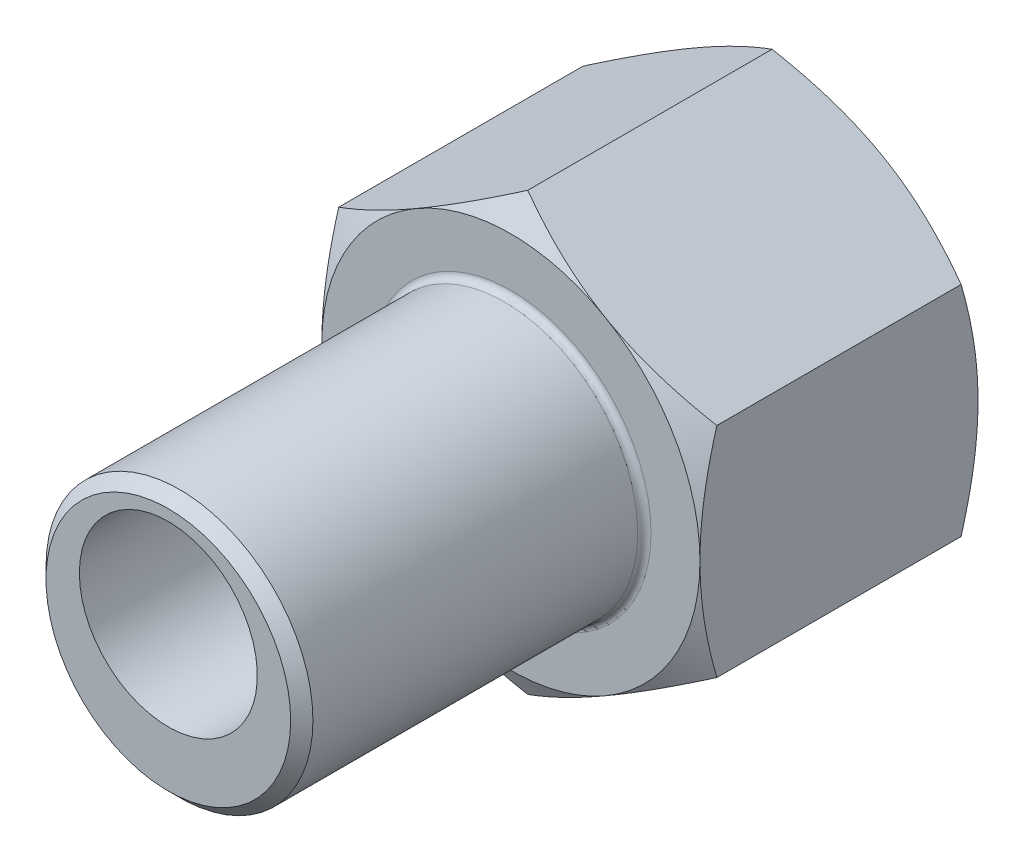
ISO-10303-21;
HEADER;
FILE_DESCRIPTION(('STEP AP214'),'2;1');
FILE_NAME('part.step','',(''),(''),'','','');
FILE_SCHEMA(('AUTOMOTIVE_DESIGN { 1 0 10303 214 1 1 1 1 }'));
ENDSEC;
DATA;
#1=APPLICATION_CONTEXT('core data for automotive mechanical design processes');
#2=APPLICATION_PROTOCOL_DEFINITION('international standard','automotive_design',2000,#1);
#3=PRODUCT_CONTEXT('',#1,'mechanical');
#4=PRODUCT('Part','Part','',(#3));
#5=PRODUCT_RELATED_PRODUCT_CATEGORY('part','',(#4));
#6=PRODUCT_DEFINITION_FORMATION('','',#4);
#7=PRODUCT_DEFINITION_CONTEXT('part definition',#1,'design');
#8=PRODUCT_DEFINITION('design','',#6,#7);
#9=PRODUCT_DEFINITION_SHAPE('','',#8);
#10=(LENGTH_UNIT() NAMED_UNIT(*) SI_UNIT(.MILLI.,.METRE.));
#11=(NAMED_UNIT(*) PLANE_ANGLE_UNIT() SI_UNIT($,.RADIAN.));
#12=(NAMED_UNIT(*) SI_UNIT($,.STERADIAN.) SOLID_ANGLE_UNIT());
#13=UNCERTAINTY_MEASURE_WITH_UNIT(LENGTH_MEASURE(1.E-05),#10,'distance_accuracy_value','');
#14=(GEOMETRIC_REPRESENTATION_CONTEXT(3) GLOBAL_UNCERTAINTY_ASSIGNED_CONTEXT((#13)) GLOBAL_UNIT_ASSIGNED_CONTEXT((#10,
#11,#12)) REPRESENTATION_CONTEXT('',''));
#15=CARTESIAN_POINT('',(0.,0.,0.));
#16=DIRECTION('',(0.,0.,1.));
#17=DIRECTION('',(1.,0.,0.));
#18=AXIS2_PLACEMENT_3D('',#15,#16,#17);
#19=CARTESIAN_POINT('',(-8.5,3.90747728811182,27.9));
#20=DIRECTION('',(-0.5,0.866025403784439,0.));
#21=DIRECTION('',(0.866025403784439,0.5,0.));
#22=AXIS2_PLACEMENT_3D('',#19,#20,#21);
#23=PLANE('',#22);
#24=DIRECTION('',(0.,0.,-1.));
#25=VECTOR('',#24,1.);
#26=CARTESIAN_POINT('',(0.,8.81495457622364,27.9));
#27=LINE('',#26,#25);
#28=CARTESIAN_POINT('',(0.,8.81495457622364,11.7408106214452));
#29=VERTEX_POINT('',#28);
#30=CARTESIAN_POINT('',(0.,8.81495457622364,0.759189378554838));
#31=VERTEX_POINT('',#30);
#32=EDGE_CURVE('E230',#29,#31,#27,.T.);
#33=ORIENTED_EDGE('',*,*,#32,.T.);
#34=CARTESIAN_POINT('',(0.000200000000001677,8.81507004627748,0.759256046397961));
#35=CARTESIAN_POINT('',(-0.186639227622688,8.70719836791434,0.696986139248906));
#36=CARTESIAN_POINT('',(-0.374175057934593,8.59892450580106,0.637542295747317));
#37=CARTESIAN_POINT('',(-0.750769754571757,8.38149745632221,0.52508511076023));
#38=CARTESIAN_POINT('',(-0.939829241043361,8.27234391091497,0.47207454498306));
#39=CARTESIAN_POINT('',(-1.51003475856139,7.94313560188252,0.323733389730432));
#40=CARTESIAN_POINT('',(-1.89343164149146,7.72178130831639,0.23935892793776));
#41=CARTESIAN_POINT('',(-2.46717766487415,7.39052888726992,0.140420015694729));
#42=CARTESIAN_POINT('',(-2.65581276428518,7.28162036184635,0.112235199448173));
#43=CARTESIAN_POINT('',(-3.0339360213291,7.06331079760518,0.064974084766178));
#44=CARTESIAN_POINT('',(-3.22342410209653,6.95390980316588,0.0458969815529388));
#45=CARTESIAN_POINT('',(-3.60272652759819,6.73491944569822,0.0173347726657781));
#46=CARTESIAN_POINT('',(-3.79254025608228,6.62533043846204,0.00783878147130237));
#47=CARTESIAN_POINT('',(-4.17234305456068,6.40605119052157,-0.00135762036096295));
#48=CARTESIAN_POINT('',(-4.36233211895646,6.29636095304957,-0.00105833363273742));
#49=CARTESIAN_POINT('',(-4.71752301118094,6.09129139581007,0.0086544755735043));
#50=CARTESIAN_POINT('',(-4.88274990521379,5.99589760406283,0.0168831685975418));
#51=CARTESIAN_POINT('',(-5.21281671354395,5.80533344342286,0.0405892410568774));
#52=CARTESIAN_POINT('',(-5.37765660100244,5.71016309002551,0.0560671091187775));
#53=CARTESIAN_POINT('',(-5.87153810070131,5.42502047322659,0.113008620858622));
#54=CARTESIAN_POINT('',(-6.19970550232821,5.23555293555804,0.164973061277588));
#55=CARTESIAN_POINT('',(-6.85952142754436,4.8546080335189,0.294884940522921));
#56=CARTESIAN_POINT('',(-7.19108574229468,4.66317928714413,0.373383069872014));
#57=CARTESIAN_POINT('',(-7.84926989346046,4.28317649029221,0.551541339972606));
#58=CARTESIAN_POINT('',(-8.17589815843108,4.09459757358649,0.651159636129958));
#59=CARTESIAN_POINT('',(-8.5002,3.90736181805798,0.759256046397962));
#60=B_SPLINE_CURVE_WITH_KNOTS('',3,(#34,#35,#36,#37,#38,#39,#40,#41,#42,#43,#44,#45,#46,#47,#48,
#49,#50,#51,#52,#53,#54,#55,#56,#57,#58,#59),.UNSPECIFIED.,.F.,.F.,(4,2,2,2,2,2,2,2,2,2,2,2,4),
(0.,0.673596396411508,1.34748239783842,2.69805431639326,3.35679995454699,4.01548737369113,
4.67342558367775,5.33134346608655,5.9040955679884,6.47688628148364,7.62328361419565,
8.79510569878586,9.96462743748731),.UNSPECIFIED.);
#61=CARTESIAN_POINT('',(-4.25,6.36121593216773,0.));
#62=VERTEX_POINT('',#61);
#63=EDGE_CURVE('E36',#31,#62,#60,.T.);
#64=ORIENTED_EDGE('',*,*,#63,.T.);
#65=CARTESIAN_POINT('',(-8.5,3.90747728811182,0.759189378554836));
#66=VERTEX_POINT('',#65);
#67=EDGE_CURVE('E187',#62,#66,#60,.T.);
#68=ORIENTED_EDGE('',*,*,#67,.T.);
#69=DIRECTION('',(0.,0.,-1.));
#70=VECTOR('',#69,1.);
#71=CARTESIAN_POINT('',(-8.5,3.90747728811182,27.9));
#72=LINE('',#71,#70);
#73=CARTESIAN_POINT('',(-8.5,3.90747728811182,11.7408106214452));
#74=VERTEX_POINT('',#73);
#75=EDGE_CURVE('E234',#74,#66,#72,.T.);
#76=ORIENTED_EDGE('',*,*,#75,.F.);
#77=CARTESIAN_POINT('',(-8.5002,3.90736181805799,11.740743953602));
#78=CARTESIAN_POINT('',(-8.31336077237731,4.01523349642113,11.8030138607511));
#79=CARTESIAN_POINT('',(-8.1258249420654,4.12350735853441,11.8624577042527));
#80=CARTESIAN_POINT('',(-7.74923024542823,4.34093440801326,11.9749148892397));
#81=CARTESIAN_POINT('',(-7.56017075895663,4.45008795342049,12.0279254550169));
#82=CARTESIAN_POINT('',(-6.9899652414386,4.77929626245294,12.1762666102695));
#83=CARTESIAN_POINT('',(-6.60656835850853,5.00065055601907,12.2606410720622));
#84=CARTESIAN_POINT('',(-6.03282233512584,5.33190297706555,12.3595799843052));
#85=CARTESIAN_POINT('',(-5.84418723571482,5.44081150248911,12.3877648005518));
#86=CARTESIAN_POINT('',(-5.46606397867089,5.65912106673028,12.4350259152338));
#87=CARTESIAN_POINT('',(-5.27657589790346,5.76852206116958,12.454103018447));
#88=CARTESIAN_POINT('',(-4.8972734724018,5.98751241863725,12.4826652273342));
#89=CARTESIAN_POINT('',(-4.70745974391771,6.09710142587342,12.4921612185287));
#90=CARTESIAN_POINT('',(-4.32765694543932,6.3163806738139,12.5013576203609));
#91=CARTESIAN_POINT('',(-4.13766788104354,6.42607091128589,12.5010583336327));
#92=CARTESIAN_POINT('',(-3.78247698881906,6.63114046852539,12.4913455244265));
#93=CARTESIAN_POINT('',(-3.6172500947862,6.72653426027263,12.4831168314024));
#94=CARTESIAN_POINT('',(-3.28718328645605,6.9170984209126,12.4594107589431));
#95=CARTESIAN_POINT('',(-3.12234339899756,7.01226877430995,12.4439328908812));
#96=CARTESIAN_POINT('',(-2.62846189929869,7.29741139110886,12.3869913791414));
#97=CARTESIAN_POINT('',(-2.30029449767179,7.48687892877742,12.3350269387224));
#98=CARTESIAN_POINT('',(-1.64047857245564,7.86782383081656,12.2051150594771));
#99=CARTESIAN_POINT('',(-1.30891425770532,8.05925257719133,12.126616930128));
#100=CARTESIAN_POINT('',(-0.650730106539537,8.43925537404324,11.9484586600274));
#101=CARTESIAN_POINT('',(-0.324101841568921,8.62783429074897,11.84884036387));
#102=CARTESIAN_POINT('',(0.00020000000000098,8.81507004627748,11.740743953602));
#103=B_SPLINE_CURVE_WITH_KNOTS('',3,(#77,#78,#79,#80,#81,#82,#83,#84,#85,#86,#87,#88,#89,#90,
#91,#92,#93,#94,#95,#96,#97,#98,#99,#100,#101,#102),.UNSPECIFIED.,.F.,.F.,(4,2,2,2,2,2,2,2,2,2,
2,2,4),(0.,0.673596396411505,1.34748239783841,2.69805431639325,3.35679995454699,
4.01548737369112,4.67342558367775,5.33134346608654,5.90409556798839,6.47688628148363,
7.62328361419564,8.79510569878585,9.96462743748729),.UNSPECIFIED.);
#104=CARTESIAN_POINT('',(-4.25,6.36121593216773,12.5));
#105=VERTEX_POINT('',#104);
#106=EDGE_CURVE('E285',#74,#105,#103,.T.);
#107=ORIENTED_EDGE('',*,*,#106,.T.);
#108=EDGE_CURVE('E278',#105,#29,#103,.T.);
#109=ORIENTED_EDGE('',*,*,#108,.T.);
#110=EDGE_LOOP('',(#33,#64,#68,#76,#107,#109));
#111=FACE_BOUND('',#110,.T.);
#112=ADVANCED_FACE('F14',(#111),#23,.T.);
#113=CARTESIAN_POINT('',(-8.5,-5.90747728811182,27.9));
#114=DIRECTION('',(-1.,0.,0.));
#115=DIRECTION('',(0.,1.,0.));
#116=AXIS2_PLACEMENT_3D('',#113,#114,#115);
#117=PLANE('',#116);
#118=ORIENTED_EDGE('',*,*,#75,.T.);
#119=CARTESIAN_POINT('',(-8.5,-14.1777810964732,4.14613920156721));
#120=CARTESIAN_POINT('',(-8.5,-13.8065738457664,3.9660877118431));
#121=CARTESIAN_POINT('',(-8.5,-13.4345140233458,3.78776384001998));
#122=CARTESIAN_POINT('',(-8.5,-12.6882358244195,3.43554303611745));
#123=CARTESIAN_POINT('',(-8.5,-12.3140171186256,3.26164680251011));
#124=CARTESIAN_POINT('',(-8.5,-11.5610375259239,2.91837716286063));
#125=CARTESIAN_POINT('',(-8.5,-11.1822629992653,2.74903357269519));
#126=CARTESIAN_POINT('',(-8.5,-10.4216999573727,2.41728197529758));
#127=CARTESIAN_POINT('',(-8.5,-10.0399115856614,2.25487364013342));
#128=CARTESIAN_POINT('',(-8.5,-9.26039049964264,1.93374721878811));
#129=CARTESIAN_POINT('',(-8.5,-8.86253938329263,1.77531495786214));
#130=CARTESIAN_POINT('',(-8.5,-8.06218188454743,1.4704515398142));
#131=CARTESIAN_POINT('',(-8.5,-7.65967498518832,1.32402173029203));
#132=CARTESIAN_POINT('',(-8.5,-6.85011551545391,1.04701097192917));
#133=CARTESIAN_POINT('',(-8.5,-6.44307405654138,0.916397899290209));
#134=CARTESIAN_POINT('',(-8.5,-5.62316685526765,0.675212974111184));
#135=CARTESIAN_POINT('',(-8.5,-5.21030299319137,0.56463480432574));
#136=CARTESIAN_POINT('',(-8.5,-4.38074750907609,0.369426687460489));
#137=CARTESIAN_POINT('',(-8.5,-3.96409000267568,0.284655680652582));
#138=CARTESIAN_POINT('',(-8.5,-3.33531284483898,0.180524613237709));
#139=CARTESIAN_POINT('',(-8.5,-3.12507312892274,0.149650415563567));
#140=CARTESIAN_POINT('',(-8.5,-2.7035501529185,0.0961828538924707));
#141=CARTESIAN_POINT('',(-8.5,-2.49226699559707,0.0735886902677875));
#142=CARTESIAN_POINT('',(-8.5,-2.07169810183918,0.0374144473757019));
#143=CARTESIAN_POINT('',(-8.5,-1.86242216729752,0.0237208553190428));
#144=CARTESIAN_POINT('',(-8.5,-1.4434788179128,0.0051953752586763));
#145=CARTESIAN_POINT('',(-8.5,-1.23381140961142,0.000363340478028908));
#146=CARTESIAN_POINT('',(-8.5,-0.814460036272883,-0.000323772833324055));
#147=CARTESIAN_POINT('',(-8.5,-0.604776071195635,0.00382117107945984));
#148=CARTESIAN_POINT('',(-8.5,-0.185769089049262,0.0209868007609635));
#149=CARTESIAN_POINT('',(-8.5,0.023553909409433,0.0340079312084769));
#150=CARTESIAN_POINT('',(-8.5,0.526762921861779,0.0757045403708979));
#151=CARTESIAN_POINT('',(-8.5,0.820306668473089,0.108599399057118));
#152=CARTESIAN_POINT('',(-8.49999999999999,1.40519875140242,0.190049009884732));
#153=CARTESIAN_POINT('',(-8.5,1.69654678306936,0.238605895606));
#154=CARTESIAN_POINT('',(-8.5,2.5669746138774,0.405193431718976));
#155=CARTESIAN_POINT('',(-8.49999999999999,3.1421090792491,0.544110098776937));
#156=CARTESIAN_POINT('',(-8.49999999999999,4.00205454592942,0.784791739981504));
#157=CARTESIAN_POINT('',(-8.49999999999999,4.29133182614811,0.871515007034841));
#158=CARTESIAN_POINT('',(-8.49999999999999,4.86707652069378,1.05391764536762));
#159=CARTESIAN_POINT('',(-8.49999999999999,5.15354391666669,1.1495970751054));
#160=CARTESIAN_POINT('',(-8.49999999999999,5.72375963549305,1.34838120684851));
#161=CARTESIAN_POINT('',(-8.49999999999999,6.00750883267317,1.45148342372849));
#162=CARTESIAN_POINT('',(-8.49999999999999,6.57266006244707,1.66390518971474));
#163=CARTESIAN_POINT('',(-8.5,6.85406212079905,1.77322467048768));
#164=CARTESIAN_POINT('',(-8.5,7.51090178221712,2.03541757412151));
#165=CARTESIAN_POINT('',(-8.49999999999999,7.88550599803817,2.19037473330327));
#166=CARTESIAN_POINT('',(-8.49999999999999,8.63157959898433,2.50768162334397));
#167=CARTESIAN_POINT('',(-8.49999999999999,9.00304880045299,2.67003178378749));
#168=CARTESIAN_POINT('',(-8.49999999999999,9.74342593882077,3.00066521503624));
#169=CARTESIAN_POINT('',(-8.49999999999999,10.1123333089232,3.1689497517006));
#170=CARTESIAN_POINT('',(-8.49999999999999,10.8479279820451,3.5102724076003));
#171=CARTESIAN_POINT('',(-8.49999999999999,11.2146153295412,3.68331043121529));
#172=CARTESIAN_POINT('',(-8.49999999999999,11.9465207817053,4.03344692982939));
#173=CARTESIAN_POINT('',(-8.49999999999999,12.3117369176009,4.21054951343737));
#174=CARTESIAN_POINT('',(-8.49999999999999,13.0406004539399,4.56795676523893));
#175=CARTESIAN_POINT('',(-8.49999999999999,13.4042478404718,4.74826146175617));
#176=CARTESIAN_POINT('',(-8.49999999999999,14.4931134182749,5.29309116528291));
#177=CARTESIAN_POINT('',(-8.49999999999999,15.2163494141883,5.66157730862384));
#178=CARTESIAN_POINT('',(-8.49999999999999,16.5995826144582,6.37536698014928));
#179=CARTESIAN_POINT('',(-8.49999999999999,17.2598848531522,6.72008201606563));
#180=CARTESIAN_POINT('',(-8.49999999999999,18.5780148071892,7.41426159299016));
#181=CARTESIAN_POINT('',(-8.49999999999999,19.2358424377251,7.7637262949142));
#182=CARTESIAN_POINT('',(-8.49999999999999,20.5479609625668,8.46542420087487));
#183=CARTESIAN_POINT('',(-8.49999999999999,21.2022565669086,8.81764861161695));
#184=CARTESIAN_POINT('',(-8.49999999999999,22.5092609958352,9.52494664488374));
#185=CARTESIAN_POINT('',(-8.49999999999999,23.1619699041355,9.88002011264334));
#186=CARTESIAN_POINT('',(-8.5,23.8140927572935,10.2361594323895));
#187=B_SPLINE_CURVE_WITH_KNOTS('',3,(#119,#120,#121,#122,#123,#124,#125,#126,#127,#128,#129,
#130,#131,#132,#133,#134,#135,#136,#137,#138,#139,#140,#141,#142,#143,#144,#145,#146,#147,#148,
#149,#150,#151,#152,#153,#154,#155,#156,#157,#158,#159,#160,#161,#162,#163,#164,#165,#166,#167,
#168,#169,#170,#171,#172,#173,#174,#175,#176,#177,#178,#179,#180,#181,#182,#183,#184,#185,#186),
.UNSPECIFIED.,.F.,.F.,(4,2,2,2,2,2,2,2,2,2,2,2,2,2,2,2,2,2,2,2,2,2,2,2,2,2,2,2,2,2,2,2,2,4),(0.,
1.23772279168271,2.47563964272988,3.72030339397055,4.96490822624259,6.24946673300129,
7.53416926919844,8.81621718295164,10.0978601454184,11.3723664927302,12.0097128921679,
12.6469977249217,13.2759866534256,13.9049651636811,14.5339452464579,15.1629568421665,
16.0485995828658,16.9343630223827,18.7068769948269,19.6127934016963,20.5187157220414,
21.4243361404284,22.329946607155,23.5460067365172,24.762137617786,25.9785294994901,
27.1948969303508,28.4125533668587,29.630220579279,32.065240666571,34.299822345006,
36.5344799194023,38.7637061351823,40.9928120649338),.UNSPECIFIED.);
#188=CARTESIAN_POINT('',(-8.5,-1.,0.));
#189=VERTEX_POINT('',#188);
#190=EDGE_CURVE('E185',#66,#189,#187,.F.);
#191=ORIENTED_EDGE('',*,*,#190,.T.);
#192=CARTESIAN_POINT('',(-8.5,-5.90747728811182,0.759189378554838));
#193=VERTEX_POINT('',#192);
#194=EDGE_CURVE('E178',#189,#193,#187,.F.);
#195=ORIENTED_EDGE('',*,*,#194,.T.);
#196=DIRECTION('',(0.,0.,-1.));
#197=VECTOR('',#196,1.);
#198=CARTESIAN_POINT('',(-8.5,-5.90747728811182,27.9));
#199=LINE('',#198,#197);
#200=CARTESIAN_POINT('',(-8.5,-5.90747728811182,11.7408106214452));
#201=VERTEX_POINT('',#200);
#202=EDGE_CURVE('E238',#201,#193,#199,.T.);
#203=ORIENTED_EDGE('',*,*,#202,.F.);
#204=CARTESIAN_POINT('',(-8.5,-14.2505989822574,8.31850276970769));
#205=CARTESIAN_POINT('',(-8.5,-13.8787768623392,8.49914423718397));
#206=CARTESIAN_POINT('',(-8.5,-13.506108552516,8.67807339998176));
#207=CARTESIAN_POINT('',(-8.5,-12.7586298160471,9.03154548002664));
#208=CARTESIAN_POINT('',(-8.5,-12.3838190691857,9.20608771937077));
#209=CARTESIAN_POINT('',(-8.5,-11.629707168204,9.55068786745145));
#210=CARTESIAN_POINT('',(-8.5,-11.250392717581,9.72071677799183));
#211=CARTESIAN_POINT('',(-8.5,-10.488770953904,10.0539077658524));
#212=CARTESIAN_POINT('',(-8.5,-10.1064637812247,10.2170701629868));
#213=CARTESIAN_POINT('',(-8.5,-9.32562788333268,10.5399360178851));
#214=CARTESIAN_POINT('',(-8.5,-8.92697876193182,10.6993498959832));
#215=CARTESIAN_POINT('',(-8.5,-8.12504287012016,11.0062777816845));
#216=CARTESIAN_POINT('',(-8.5,-7.72175558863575,11.1537904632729));
#217=CARTESIAN_POINT('',(-8.5,-6.91062990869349,11.4330930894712));
#218=CARTESIAN_POINT('',(-8.5,-6.5028023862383,11.5649142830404));
#219=CARTESIAN_POINT('',(-8.5,-5.68131175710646,11.8086507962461));
#220=CARTESIAN_POINT('',(-8.5,-5.26765051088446,11.9205723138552));
#221=CARTESIAN_POINT('',(-8.5,-4.43650941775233,12.1185749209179));
#222=CARTESIAN_POINT('',(-8.5,-4.01906464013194,12.2047992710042));
#223=CARTESIAN_POINT('',(-8.5,-3.38904166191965,12.311167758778));
#224=CARTESIAN_POINT('',(-8.5,-3.17837635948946,12.3427973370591));
#225=CARTESIAN_POINT('',(-8.5,-2.75597548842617,12.3977817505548));
#226=CARTESIAN_POINT('',(-8.5,-2.54424002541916,12.4211373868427));
#227=CARTESIAN_POINT('',(-8.5,-2.12277827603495,12.4588120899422));
#228=CARTESIAN_POINT('',(-8.5,-1.91306232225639,12.4732462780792));
#229=CARTESIAN_POINT('',(-8.5,-1.49320773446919,12.4932296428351));
#230=CARTESIAN_POINT('',(-8.5,-1.28306910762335,12.4987789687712));
#231=CARTESIAN_POINT('',(-8.5,-0.86274560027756,12.5008599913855));
#232=CARTESIAN_POINT('',(-8.5,-0.652560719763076,12.4973916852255));
#233=CARTESIAN_POINT('',(-8.5,-0.232525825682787,12.4815231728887));
#234=CARTESIAN_POINT('',(-8.5,-0.0226758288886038,12.4691225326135));
#235=CARTESIAN_POINT('',(-8.5,0.479603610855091,12.4290155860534));
#236=CARTESIAN_POINT('',(-8.5,0.77171089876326,12.3971853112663));
#237=CARTESIAN_POINT('',(-8.49999999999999,1.35378845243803,12.3179384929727));
#238=CARTESIAN_POINT('',(-8.5,1.64375843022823,12.2705198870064));
#239=CARTESIAN_POINT('',(-8.5,2.51011453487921,12.1073932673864));
#240=CARTESIAN_POINT('',(-8.49999999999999,3.08262995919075,11.9708431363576));
#241=CARTESIAN_POINT('',(-8.49999999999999,3.9387590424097,11.7336571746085));
#242=CARTESIAN_POINT('',(-8.49999999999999,4.2268033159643,11.6480903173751));
#243=CARTESIAN_POINT('',(-8.49999999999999,4.80009529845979,11.4679683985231));
#244=CARTESIAN_POINT('',(-8.49999999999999,5.0853429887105,11.3734132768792));
#245=CARTESIAN_POINT('',(-8.49999999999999,5.6531292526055,11.1768402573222));
#246=CARTESIAN_POINT('',(-8.49999999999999,5.93566866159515,11.0748247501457));
#247=CARTESIAN_POINT('',(-8.49999999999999,6.4984001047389,10.8645412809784));
#248=CARTESIAN_POINT('',(-8.5,6.77859216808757,10.7562733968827));
#249=CARTESIAN_POINT('',(-8.5,7.44619226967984,10.4911062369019));
#250=CARTESIAN_POINT('',(-8.49999999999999,7.83262779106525,10.3317628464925));
#251=CARTESIAN_POINT('',(-8.49999999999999,8.60214600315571,10.0051522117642));
#252=CARTESIAN_POINT('',(-8.49999999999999,8.98522847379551,9.83788445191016));
#253=CARTESIAN_POINT('',(-8.49999999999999,9.74867452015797,9.49703208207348));
#254=CARTESIAN_POINT('',(-8.49999999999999,10.1290374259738,9.32344597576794));
#255=CARTESIAN_POINT('',(-8.49999999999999,10.8874129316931,8.97124844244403));
#256=CARTESIAN_POINT('',(-8.49999999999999,11.265425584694,8.79263712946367));
#257=CARTESIAN_POINT('',(-8.49999999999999,12.0199283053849,8.4311347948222));
#258=CARTESIAN_POINT('',(-8.49999999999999,12.3964161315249,8.24823910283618));
#259=CARTESIAN_POINT('',(-8.49999999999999,13.1477464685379,7.87910020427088));
#260=CARTESIAN_POINT('',(-8.49999999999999,13.5225889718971,7.6928569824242));
#261=CARTESIAN_POINT('',(-8.49999999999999,14.6449440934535,7.13005754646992));
#262=CARTESIAN_POINT('',(-8.49999999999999,15.3903900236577,6.74938048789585));
#263=CARTESIAN_POINT('',(-8.49999999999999,16.8136253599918,6.0132593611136));
#264=CARTESIAN_POINT('',(-8.49999999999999,17.4917423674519,5.65844580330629));
#265=CARTESIAN_POINT('',(-8.49999999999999,18.8454507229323,4.94397500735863));
#266=CARTESIAN_POINT('',(-8.49999999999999,19.5210419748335,4.58431758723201));
#267=CARTESIAN_POINT('',(-8.49999999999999,20.8685020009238,3.86226300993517));
#268=CARTESIAN_POINT('',(-8.49999999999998,21.540375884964,3.4998753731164));
#269=CARTESIAN_POINT('',(-8.49999999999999,22.8825124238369,2.77221927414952));
#270=CARTESIAN_POINT('',(-8.49999999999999,23.5527751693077,2.40695097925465));
#271=CARTESIAN_POINT('',(-8.5,24.2224470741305,2.04060993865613));
#272=B_SPLINE_CURVE_WITH_KNOTS('',3,(#204,#205,#206,#207,#208,#209,#210,#211,#212,#213,#214,
#215,#216,#217,#218,#219,#220,#221,#222,#223,#224,#225,#226,#227,#228,#229,#230,#231,#232,#233,
#234,#235,#236,#237,#238,#239,#240,#241,#242,#243,#244,#245,#246,#247,#248,#249,#250,#251,#252,
#253,#254,#255,#256,#257,#258,#259,#260,#261,#262,#263,#264,#265,#266,#267,#268,#269,#270,#271),
.UNSPECIFIED.,.F.,.F.,(4,2,2,2,2,2,2,2,2,2,2,2,2,2,2,2,2,2,2,2,2,2,2,2,2,2,2,2,2,2,2,2,2,4),(0.,
1.24015482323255,2.48050012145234,3.72748345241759,4.97440863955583,6.26228487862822,
7.55030441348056,8.83571440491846,10.1207233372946,11.3984283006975,12.0373709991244,
12.6762518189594,13.3067063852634,13.9371503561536,14.5675945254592,15.198069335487,
16.0790820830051,16.9602114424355,18.7234203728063,19.624798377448,20.5261824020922,
21.4272788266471,22.3283640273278,23.5822393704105,24.8361963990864,26.0904523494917,
27.3446798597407,28.6003448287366,29.8560155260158,32.3670047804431,34.6629844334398,
36.9590505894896,39.2491640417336,41.539145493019),.UNSPECIFIED.);
#273=CARTESIAN_POINT('',(-8.5,-1.,12.5));
#274=VERTEX_POINT('',#273);
#275=EDGE_CURVE('E211',#201,#274,#272,.T.);
#276=ORIENTED_EDGE('',*,*,#275,.T.);
#277=EDGE_CURVE('E203',#274,#74,#272,.T.);
#278=ORIENTED_EDGE('',*,*,#277,.T.);
#279=EDGE_LOOP('',(#118,#191,#195,#203,#276,#278));
#280=FACE_BOUND('',#279,.T.);
#281=ADVANCED_FACE('F194',(#280),#117,.T.);
#282=CARTESIAN_POINT('',(0.,-10.8149545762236,27.9));
#283=DIRECTION('',(-0.5,-0.866025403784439,0.));
#284=DIRECTION('',(-0.866025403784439,0.5,0.));
#285=AXIS2_PLACEMENT_3D('',#282,#283,#284);
#286=PLANE('',#285);
#287=ORIENTED_EDGE('',*,*,#202,.T.);
#288=CARTESIAN_POINT('',(-8.5002,-5.90736181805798,0.759256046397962));
#289=CARTESIAN_POINT('',(-8.31336077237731,-6.01523349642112,0.696986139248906));
#290=CARTESIAN_POINT('',(-8.12582494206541,-6.1235073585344,0.637542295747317));
#291=CARTESIAN_POINT('',(-7.74923024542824,-6.34093440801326,0.52508511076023));
#292=CARTESIAN_POINT('',(-7.56017075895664,-6.45008795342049,0.472074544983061));
#293=CARTESIAN_POINT('',(-6.98996524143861,-6.77929626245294,0.323733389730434));
#294=CARTESIAN_POINT('',(-6.60656835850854,-7.00065055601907,0.239358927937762));
#295=CARTESIAN_POINT('',(-6.03282233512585,-7.33190297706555,0.140420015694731));
#296=CARTESIAN_POINT('',(-5.84418723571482,-7.44081150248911,0.112235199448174));
#297=CARTESIAN_POINT('',(-5.4660639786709,-7.65912106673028,0.0649740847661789));
#298=CARTESIAN_POINT('',(-5.27657589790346,-7.76852206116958,0.0458969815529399));
#299=CARTESIAN_POINT('',(-4.8972734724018,-7.98751241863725,0.0173347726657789));
#300=CARTESIAN_POINT('',(-4.70745974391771,-8.09710142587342,0.00783878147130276));
#301=CARTESIAN_POINT('',(-4.32765694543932,-8.3163806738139,-0.00135762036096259));
#302=CARTESIAN_POINT('',(-4.13766788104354,-8.42607091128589,-0.0010583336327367));
#303=CARTESIAN_POINT('',(-3.78247698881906,-8.63114046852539,0.00865447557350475));
#304=CARTESIAN_POINT('',(-3.6172500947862,-8.72653426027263,0.0168831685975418));
#305=CARTESIAN_POINT('',(-3.28718328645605,-8.9170984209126,0.0405892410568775));
#306=CARTESIAN_POINT('',(-3.12234339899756,-9.01226877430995,0.0560671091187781));
#307=CARTESIAN_POINT('',(-2.62846189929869,-9.29741139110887,0.113008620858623));
#308=CARTESIAN_POINT('',(-2.30029449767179,-9.48687892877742,0.164973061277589));
#309=CARTESIAN_POINT('',(-1.64047857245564,-9.86782383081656,0.294884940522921));
#310=CARTESIAN_POINT('',(-1.30891425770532,-10.0592525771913,0.373383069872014));
#311=CARTESIAN_POINT('',(-0.650730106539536,-10.4392553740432,0.551541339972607));
#312=CARTESIAN_POINT('',(-0.324101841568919,-10.627834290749,0.651159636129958));
#313=CARTESIAN_POINT('',(0.000200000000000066,-10.8150700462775,0.759256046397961));
#314=B_SPLINE_CURVE_WITH_KNOTS('',3,(#288,#289,#290,#291,#292,#293,#294,#295,#296,#297,#298,
#299,#300,#301,#302,#303,#304,#305,#306,#307,#308,#309,#310,#311,#312,#313),.UNSPECIFIED.,.F.,
.F.,(4,2,2,2,2,2,2,2,2,2,2,2,4),(0.,0.673596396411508,1.34748239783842,2.69805431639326,
3.356799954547,4.01548737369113,4.67342558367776,5.33134346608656,5.9040955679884,
6.47688628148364,7.62328361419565,8.79510569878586,9.96462743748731),.UNSPECIFIED.);
#315=CARTESIAN_POINT('',(-4.25,-8.36121593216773,0.));
#316=VERTEX_POINT('',#315);
#317=EDGE_CURVE('E186',#193,#316,#314,.T.);
#318=ORIENTED_EDGE('',*,*,#317,.T.);
#319=CARTESIAN_POINT('',(0.,-10.8149545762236,0.759189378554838));
#320=VERTEX_POINT('',#319);
#321=EDGE_CURVE('E171',#316,#320,#314,.T.);
#322=ORIENTED_EDGE('',*,*,#321,.T.);
#323=DIRECTION('',(0.,0.,-1.));
#324=VECTOR('',#323,1.);
#325=CARTESIAN_POINT('',(0.,-10.8149545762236,27.9));
#326=LINE('',#325,#324);
#327=CARTESIAN_POINT('',(0.,-10.8149545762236,11.7408106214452));
#328=VERTEX_POINT('',#327);
#329=EDGE_CURVE('E241',#328,#320,#326,.T.);
#330=ORIENTED_EDGE('',*,*,#329,.F.);
#331=CARTESIAN_POINT('',(0.000200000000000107,-10.8150700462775,11.740743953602));
#332=CARTESIAN_POINT('',(-0.186639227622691,-10.7071983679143,11.8030138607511));
#333=CARTESIAN_POINT('',(-0.374175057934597,-10.5989245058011,11.8624577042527));
#334=CARTESIAN_POINT('',(-0.750769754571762,-10.3814974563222,11.9749148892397));
#335=CARTESIAN_POINT('',(-0.939829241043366,-10.272343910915,12.0279254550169));
#336=CARTESIAN_POINT('',(-1.5100347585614,-9.94313560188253,12.1762666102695));
#337=CARTESIAN_POINT('',(-1.89343164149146,-9.72178130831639,12.2606410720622));
#338=CARTESIAN_POINT('',(-2.46717766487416,-9.39052888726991,12.3595799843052));
#339=CARTESIAN_POINT('',(-2.65581276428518,-9.28162036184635,12.3877648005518));
#340=CARTESIAN_POINT('',(-3.03393602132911,-9.06331079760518,12.4350259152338));
#341=CARTESIAN_POINT('',(-3.22342410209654,-8.95390980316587,12.454103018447));
#342=CARTESIAN_POINT('',(-3.6027265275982,-8.73491944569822,12.4826652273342));
#343=CARTESIAN_POINT('',(-3.79254025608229,-8.62533043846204,12.4921612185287));
#344=CARTESIAN_POINT('',(-4.17234305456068,-8.40605119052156,12.5013576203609));
#345=CARTESIAN_POINT('',(-4.36233211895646,-8.29636095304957,12.5010583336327));
#346=CARTESIAN_POINT('',(-4.71752301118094,-8.09129139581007,12.4913455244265));
#347=CARTESIAN_POINT('',(-4.88274990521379,-7.99589760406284,12.4831168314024));
#348=CARTESIAN_POINT('',(-5.21281671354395,-7.80533344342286,12.4594107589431));
#349=CARTESIAN_POINT('',(-5.37765660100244,-7.71016309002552,12.4439328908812));
#350=CARTESIAN_POINT('',(-5.87153810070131,-7.4250204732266,12.3869913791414));
#351=CARTESIAN_POINT('',(-6.19970550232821,-7.23555293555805,12.3350269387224));
#352=CARTESIAN_POINT('',(-6.85952142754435,-6.8546080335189,12.2051150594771));
#353=CARTESIAN_POINT('',(-7.19108574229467,-6.66317928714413,12.126616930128));
#354=CARTESIAN_POINT('',(-7.84926989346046,-6.28317649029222,11.9484586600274));
#355=CARTESIAN_POINT('',(-8.17589815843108,-6.09459757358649,11.84884036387));
#356=CARTESIAN_POINT('',(-8.5002,-5.90736181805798,11.740743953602));
#357=B_SPLINE_CURVE_WITH_KNOTS('',3,(#331,#332,#333,#334,#335,#336,#337,#338,#339,#340,#341,
#342,#343,#344,#345,#346,#347,#348,#349,#350,#351,#352,#353,#354,#355,#356),.UNSPECIFIED.,.F.,
.F.,(4,2,2,2,2,2,2,2,2,2,2,2,4),(0.,0.673596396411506,1.34748239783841,2.69805431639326,
3.35679995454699,4.01548737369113,4.67342558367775,5.33134346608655,5.90409556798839,
6.47688628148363,7.62328361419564,8.79510569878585,9.9646274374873),.UNSPECIFIED.);
#358=CARTESIAN_POINT('',(-4.25,-8.36121593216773,12.5));
#359=VERTEX_POINT('',#358);
#360=EDGE_CURVE('E225',#328,#359,#357,.T.);
#361=ORIENTED_EDGE('',*,*,#360,.T.);
#362=EDGE_CURVE('E218',#359,#201,#357,.T.);
#363=ORIENTED_EDGE('',*,*,#362,.T.);
#364=EDGE_LOOP('',(#287,#318,#322,#330,#361,#363));
#365=FACE_BOUND('',#364,.T.);
#366=ADVANCED_FACE('F197',(#365),#286,.T.);
#367=CARTESIAN_POINT('',(8.5,-5.90747728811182,27.9));
#368=DIRECTION('',(0.5,-0.866025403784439,0.));
#369=DIRECTION('',(-0.866025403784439,-0.5,0.));
#370=AXIS2_PLACEMENT_3D('',#367,#368,#369);
#371=PLANE('',#370);
#372=ORIENTED_EDGE('',*,*,#329,.T.);
#373=CARTESIAN_POINT('',(-0.000200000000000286,-10.8150700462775,0.759256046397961));
#374=CARTESIAN_POINT('',(0.186639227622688,-10.7071983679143,0.696986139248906));
#375=CARTESIAN_POINT('',(0.374175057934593,-10.5989245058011,0.637542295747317));
#376=CARTESIAN_POINT('',(0.750769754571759,-10.3814974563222,0.525085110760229));
#377=CARTESIAN_POINT('',(0.939829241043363,-10.272343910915,0.47207454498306));
#378=CARTESIAN_POINT('',(1.51003475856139,-9.94313560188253,0.323733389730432));
#379=CARTESIAN_POINT('',(1.89343164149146,-9.72178130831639,0.239358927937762));
#380=CARTESIAN_POINT('',(2.46717766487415,-9.39052888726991,0.14042001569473));
#381=CARTESIAN_POINT('',(2.65581276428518,-9.28162036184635,0.112235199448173));
#382=CARTESIAN_POINT('',(3.0339360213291,-9.06331079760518,0.0649740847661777));
#383=CARTESIAN_POINT('',(3.22342410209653,-8.95390980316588,0.0458969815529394));
#384=CARTESIAN_POINT('',(3.60272652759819,-8.73491944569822,0.0173347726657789));
#385=CARTESIAN_POINT('',(3.79254025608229,-8.62533043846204,0.00783878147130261));
#386=CARTESIAN_POINT('',(4.17234305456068,-8.40605119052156,-0.00135762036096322));
#387=CARTESIAN_POINT('',(4.36233211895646,-8.29636095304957,-0.0010583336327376));
#388=CARTESIAN_POINT('',(4.71752301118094,-8.09129139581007,0.00865447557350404));
#389=CARTESIAN_POINT('',(4.88274990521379,-7.99589760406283,0.0168831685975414));
#390=CARTESIAN_POINT('',(5.21281671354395,-7.80533344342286,0.0405892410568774));
#391=CARTESIAN_POINT('',(5.37765660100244,-7.71016309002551,0.056067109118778));
#392=CARTESIAN_POINT('',(5.87153810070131,-7.42502047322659,0.113008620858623));
#393=CARTESIAN_POINT('',(6.19970550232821,-7.23555293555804,0.164973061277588));
#394=CARTESIAN_POINT('',(6.85952142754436,-6.8546080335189,0.294884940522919));
#395=CARTESIAN_POINT('',(7.19108574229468,-6.66317928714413,0.373383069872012));
#396=CARTESIAN_POINT('',(7.84926989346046,-6.28317649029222,0.551541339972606));
#397=CARTESIAN_POINT('',(8.17589815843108,-6.09459757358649,0.651159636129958));
#398=CARTESIAN_POINT('',(8.5002,-5.90736181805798,0.759256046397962));
#399=B_SPLINE_CURVE_WITH_KNOTS('',3,(#373,#374,#375,#376,#377,#378,#379,#380,#381,#382,#383,
#384,#385,#386,#387,#388,#389,#390,#391,#392,#393,#394,#395,#396,#397,#398),.UNSPECIFIED.,.F.,
.F.,(4,2,2,2,2,2,2,2,2,2,2,2,4),(0.,0.673596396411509,1.34748239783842,2.69805431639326,
3.356799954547,4.01548737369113,4.67342558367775,5.33134346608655,5.90409556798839,
6.47688628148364,7.62328361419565,8.79510569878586,9.96462743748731),.UNSPECIFIED.);
#400=CARTESIAN_POINT('',(4.25,-8.36121593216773,0.));
#401=VERTEX_POINT('',#400);
#402=EDGE_CURVE('E137',#320,#401,#399,.T.);
#403=ORIENTED_EDGE('',*,*,#402,.T.);
#404=CARTESIAN_POINT('',(8.5,-5.90747728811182,0.759189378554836));
#405=VERTEX_POINT('',#404);
#406=EDGE_CURVE('E122',#401,#405,#399,.T.);
#407=ORIENTED_EDGE('',*,*,#406,.T.);
#408=DIRECTION('',(0.,0.,-1.));
#409=VECTOR('',#408,1.);
#410=CARTESIAN_POINT('',(8.5,-5.90747728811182,27.9));
#411=LINE('',#410,#409);
#412=CARTESIAN_POINT('',(8.5,-5.90747728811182,11.7408106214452));
#413=VERTEX_POINT('',#412);
#414=EDGE_CURVE('E136',#413,#405,#411,.T.);
#415=ORIENTED_EDGE('',*,*,#414,.F.);
#416=CARTESIAN_POINT('',(8.5002,-5.90736181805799,11.740743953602));
#417=CARTESIAN_POINT('',(8.3133607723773,-6.01523349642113,11.8030138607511));
#418=CARTESIAN_POINT('',(8.1258249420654,-6.12350735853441,11.8624577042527));
#419=CARTESIAN_POINT('',(7.74923024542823,-6.34093440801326,11.9749148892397));
#420=CARTESIAN_POINT('',(7.56017075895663,-6.45008795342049,12.0279254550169));
#421=CARTESIAN_POINT('',(6.9899652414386,-6.77929626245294,12.1762666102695));
#422=CARTESIAN_POINT('',(6.60656835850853,-7.00065055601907,12.2606410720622));
#423=CARTESIAN_POINT('',(6.03282233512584,-7.33190297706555,12.3595799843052));
#424=CARTESIAN_POINT('',(5.84418723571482,-7.44081150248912,12.3877648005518));
#425=CARTESIAN_POINT('',(5.46606397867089,-7.65912106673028,12.4350259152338));
#426=CARTESIAN_POINT('',(5.27657589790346,-7.76852206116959,12.454103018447));
#427=CARTESIAN_POINT('',(4.8972734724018,-7.98751241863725,12.4826652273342));
#428=CARTESIAN_POINT('',(4.70745974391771,-8.09710142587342,12.4921612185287));
#429=CARTESIAN_POINT('',(4.32765694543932,-8.3163806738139,12.5013576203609));
#430=CARTESIAN_POINT('',(4.13766788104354,-8.42607091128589,12.5010583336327));
#431=CARTESIAN_POINT('',(3.78247698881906,-8.63114046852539,12.4913455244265));
#432=CARTESIAN_POINT('',(3.6172500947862,-8.72653426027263,12.4831168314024));
#433=CARTESIAN_POINT('',(3.28718328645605,-8.9170984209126,12.4594107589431));
#434=CARTESIAN_POINT('',(3.12234339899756,-9.01226877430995,12.4439328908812));
#435=CARTESIAN_POINT('',(2.62846189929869,-9.29741139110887,12.3869913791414));
#436=CARTESIAN_POINT('',(2.30029449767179,-9.48687892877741,12.3350269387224));
#437=CARTESIAN_POINT('',(1.64047857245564,-9.86782383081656,12.2051150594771));
#438=CARTESIAN_POINT('',(1.30891425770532,-10.0592525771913,12.126616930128));
#439=CARTESIAN_POINT('',(0.650730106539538,-10.4392553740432,11.9484586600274));
#440=CARTESIAN_POINT('',(0.324101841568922,-10.627834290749,11.84884036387));
#441=CARTESIAN_POINT('',(-0.000199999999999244,-10.8150700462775,11.740743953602));
#442=B_SPLINE_CURVE_WITH_KNOTS('',3,(#416,#417,#418,#419,#420,#421,#422,#423,#424,#425,#426,
#427,#428,#429,#430,#431,#432,#433,#434,#435,#436,#437,#438,#439,#440,#441),.UNSPECIFIED.,.F.,
.F.,(4,2,2,2,2,2,2,2,2,2,2,2,4),(0.,0.673596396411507,1.34748239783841,2.69805431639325,
3.35679995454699,4.01548737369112,4.67342558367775,5.33134346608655,5.90409556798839,
6.47688628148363,7.62328361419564,8.79510569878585,9.96462743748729),.UNSPECIFIED.);
#443=CARTESIAN_POINT('',(4.25,-8.36121593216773,12.5));
#444=VERTEX_POINT('',#443);
#445=EDGE_CURVE('E212',#413,#444,#442,.T.);
#446=ORIENTED_EDGE('',*,*,#445,.T.);
#447=EDGE_CURVE('E226',#444,#328,#442,.T.);
#448=ORIENTED_EDGE('',*,*,#447,.T.);
#449=EDGE_LOOP('',(#372,#403,#407,#415,#446,#448));
#450=FACE_BOUND('',#449,.T.);
#451=ADVANCED_FACE('F335',(#450),#371,.T.);
#452=CARTESIAN_POINT('',(8.5,3.90747728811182,27.9));
#453=DIRECTION('',(1.,0.,0.));
#454=DIRECTION('',(0.,-1.,0.));
#455=AXIS2_PLACEMENT_3D('',#452,#453,#454);
#456=PLANE('',#455);
#457=ORIENTED_EDGE('',*,*,#414,.T.);
#458=CARTESIAN_POINT('',(8.5,-14.1777810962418,4.14613920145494));
#459=CARTESIAN_POINT('',(8.5,-13.8065738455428,3.96608771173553));
#460=CARTESIAN_POINT('',(8.49999999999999,-13.43451402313,3.78776383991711));
#461=CARTESIAN_POINT('',(8.49999999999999,-12.6882358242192,3.43554303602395));
#462=CARTESIAN_POINT('',(8.49999999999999,-12.3140171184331,3.26164680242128));
#463=CARTESIAN_POINT('',(8.49999999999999,-11.5610375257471,2.91837716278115));
#464=CARTESIAN_POINT('',(8.49999999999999,-11.1822629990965,2.74903357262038));
#465=CARTESIAN_POINT('',(8.49999999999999,-10.4216999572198,2.41728197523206));
#466=CARTESIAN_POINT('',(8.49999999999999,-10.0399115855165,2.25487364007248));
#467=CARTESIAN_POINT('',(8.49999999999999,-9.26039049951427,1.93374721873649));
#468=CARTESIAN_POINT('',(8.49999999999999,-8.86253938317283,1.77531495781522));
#469=CARTESIAN_POINT('',(8.49999999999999,-8.06218188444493,1.47045153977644));
#470=CARTESIAN_POINT('',(8.5,-7.65967498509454,1.32402173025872));
#471=CARTESIAN_POINT('',(8.5,-6.85011551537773,1.04701097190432));
#472=CARTESIAN_POINT('',(8.49999999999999,-6.44307405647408,0.916397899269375));
#473=CARTESIAN_POINT('',(8.5,-5.62316685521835,0.675212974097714));
#474=CARTESIAN_POINT('',(8.5,-5.21030299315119,0.564634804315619));
#475=CARTESIAN_POINT('',(8.5,-4.38074750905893,0.369426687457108));
#476=CARTESIAN_POINT('',(8.5,-3.96409000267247,0.284655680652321));
#477=CARTESIAN_POINT('',(8.5,-3.33531284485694,0.180524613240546));
#478=CARTESIAN_POINT('',(8.5,-3.1250731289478,0.149650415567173));
#479=CARTESIAN_POINT('',(8.5,-2.7035501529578,0.096182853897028));
#480=CARTESIAN_POINT('',(8.5,-2.49226699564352,0.073588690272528));
#481=CARTESIAN_POINT('',(8.5,-2.07169810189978,0.0374144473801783));
#482=CARTESIAN_POINT('',(8.5,-1.86242216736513,0.0237208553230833));
#483=CARTESIAN_POINT('',(8.5,-1.44347881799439,0.0051953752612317));
#484=CARTESIAN_POINT('',(8.5,-1.2338114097,0.000363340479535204));
#485=CARTESIAN_POINT('',(8.5,-0.814460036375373,-0.000323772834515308));
#486=CARTESIAN_POINT('',(8.5,-0.604776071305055,0.00382117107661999));
#487=CARTESIAN_POINT('',(8.5,-0.185769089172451,0.0209868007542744));
#488=CARTESIAN_POINT('',(8.5,0.0235539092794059,0.0340079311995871));
#489=CARTESIAN_POINT('',(8.5,0.526762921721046,0.0757045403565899));
#490=CARTESIAN_POINT('',(8.5,0.82030666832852,0.108599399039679));
#491=CARTESIAN_POINT('',(8.5,1.40519875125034,0.190049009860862));
#492=CARTESIAN_POINT('',(8.5,1.69654678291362,0.238605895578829));
#493=CARTESIAN_POINT('',(8.5,2.56697461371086,0.40519343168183));
#494=CARTESIAN_POINT('',(8.5,3.14210907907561,0.544110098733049));
#495=CARTESIAN_POINT('',(8.5,4.00205454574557,0.784791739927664));
#496=CARTESIAN_POINT('',(8.5,4.29133182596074,0.871515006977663));
#497=CARTESIAN_POINT('',(8.5,4.86707652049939,1.05391764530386));
#498=CARTESIAN_POINT('',(8.5,5.15354391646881,1.14959707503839));
#499=CARTESIAN_POINT('',(8.5,5.72375963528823,1.34838120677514));
#500=CARTESIAN_POINT('',(8.5,6.00750883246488,1.45148342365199));
#501=CARTESIAN_POINT('',(8.5,6.57266006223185,1.66390518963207));
#502=CARTESIAN_POINT('',(8.5,6.85406212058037,1.77322467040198));
#503=CARTESIAN_POINT('',(8.5,7.51090178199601,2.03541757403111));
#504=CARTESIAN_POINT('',(8.5,7.88550599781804,2.19037473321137));
#505=CARTESIAN_POINT('',(8.5,8.63157959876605,2.50768162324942));
#506=CARTESIAN_POINT('',(8.5,9.00304880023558,2.67003178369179));
#507=CARTESIAN_POINT('',(8.5,9.74342593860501,3.0006652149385));
#508=CARTESIAN_POINT('',(8.5,10.1123333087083,3.16894975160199));
#509=CARTESIAN_POINT('',(8.5,10.8479279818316,3.51027240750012));
#510=CARTESIAN_POINT('',(8.5,11.2146153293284,3.68331043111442));
#511=CARTESIAN_POINT('',(8.5,11.9465207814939,4.03344692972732));
#512=CARTESIAN_POINT('',(8.5,12.3117369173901,4.21054951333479));
#513=CARTESIAN_POINT('',(8.5,13.0406004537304,4.56795676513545));
#514=CARTESIAN_POINT('',(8.5,13.404247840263,4.74826146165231));
#515=CARTESIAN_POINT('',(8.5,14.4931134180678,5.29309116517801));
#516=CARTESIAN_POINT('',(8.5,15.2163494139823,5.66157730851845));
#517=CARTESIAN_POINT('',(8.5,16.5995826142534,6.37536698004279));
#518=CARTESIAN_POINT('',(8.50000000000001,17.2598848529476,6.72008201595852));
#519=CARTESIAN_POINT('',(8.50000000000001,18.5780148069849,7.41426159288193));
#520=CARTESIAN_POINT('',(8.50000000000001,19.2358424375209,7.76372629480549));
#521=CARTESIAN_POINT('',(8.50000000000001,20.5479609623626,8.4654242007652));
#522=CARTESIAN_POINT('',(8.50000000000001,21.2022565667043,8.81764861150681));
#523=CARTESIAN_POINT('',(8.50000000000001,22.5092609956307,9.52494664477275));
#524=CARTESIAN_POINT('',(8.50000000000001,23.1619699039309,9.88002011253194));
#525=CARTESIAN_POINT('',(8.5,23.8140927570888,10.2361594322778));
#526=B_SPLINE_CURVE_WITH_KNOTS('',3,(#458,#459,#460,#461,#462,#463,#464,#465,#466,#467,#468,
#469,#470,#471,#472,#473,#474,#475,#476,#477,#478,#479,#480,#481,#482,#483,#484,#485,#486,#487,
#488,#489,#490,#491,#492,#493,#494,#495,#496,#497,#498,#499,#500,#501,#502,#503,#504,#505,#506,
#507,#508,#509,#510,#511,#512,#513,#514,#515,#516,#517,#518,#519,#520,#521,#522,#523,#524,#525),
.UNSPECIFIED.,.F.,.F.,(4,2,2,2,2,2,2,2,2,2,2,2,2,2,2,2,2,2,2,2,2,2,2,2,2,2,2,2,2,2,2,2,2,4),(0.,
1.23772279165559,2.47563964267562,3.72030339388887,4.96490822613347,6.24946673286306,
7.53416926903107,8.81621718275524,10.097860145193,11.372366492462,12.0097128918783,
12.6469977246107,13.2759866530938,13.9049651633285,14.5339452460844,15.1629568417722,
16.0485995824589,16.9343630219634,18.7068769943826,19.612793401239,20.5187157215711,
21.4243361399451,22.3299466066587,23.5460067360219,24.7621376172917,25.9785294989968,
27.1948969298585,28.4125533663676,29.630220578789,32.0652406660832,34.2998223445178,
36.5344799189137,38.7637061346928,40.9928120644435),.UNSPECIFIED.);
#527=CARTESIAN_POINT('',(8.5,-1.,0.));
#528=VERTEX_POINT('',#527);
#529=EDGE_CURVE('E115',#405,#528,#526,.T.);
#530=ORIENTED_EDGE('',*,*,#529,.T.);
#531=CARTESIAN_POINT('',(8.5,3.90747728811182,0.759189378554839));
#532=VERTEX_POINT('',#531);
#533=EDGE_CURVE('E103',#528,#532,#526,.T.);
#534=ORIENTED_EDGE('',*,*,#533,.T.);
#535=DIRECTION('',(0.,0.,-1.));
#536=VECTOR('',#535,1.);
#537=CARTESIAN_POINT('',(8.5,3.90747728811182,27.9));
#538=LINE('',#537,#536);
#539=CARTESIAN_POINT('',(8.5,3.90747728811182,11.7408106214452));
#540=VERTEX_POINT('',#539);
#541=EDGE_CURVE('E245',#540,#532,#538,.T.);
#542=ORIENTED_EDGE('',*,*,#541,.F.);
#543=CARTESIAN_POINT('',(8.5,-14.2505989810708,8.31850277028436));
#544=CARTESIAN_POINT('',(8.5,-13.8787768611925,8.49914423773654));
#545=CARTESIAN_POINT('',(8.49999999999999,-13.5061085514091,8.67807340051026));
#546=CARTESIAN_POINT('',(8.49999999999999,-12.7586298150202,9.03154548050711));
#547=CARTESIAN_POINT('',(8.49999999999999,-12.3838190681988,9.20608771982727));
#548=CARTESIAN_POINT('',(8.49999999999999,-11.6297071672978,9.55068786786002));
#549=CARTESIAN_POINT('',(8.49999999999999,-11.2503927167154,9.72071677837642));
#550=CARTESIAN_POINT('',(8.49999999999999,-10.4887709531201,10.0539077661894));
#551=CARTESIAN_POINT('',(8.49999999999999,-10.1064637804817,10.2170701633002));
#552=CARTESIAN_POINT('',(8.49999999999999,-9.32562788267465,10.5399360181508));
#553=CARTESIAN_POINT('',(8.49999999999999,-8.92697876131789,10.6993498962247));
#554=CARTESIAN_POINT('',(8.49999999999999,-8.12504286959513,11.0062777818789));
#555=CARTESIAN_POINT('',(8.5,-7.72175558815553,11.1537904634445));
#556=CARTESIAN_POINT('',(8.5,-6.91062990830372,11.4330930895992));
#557=CARTESIAN_POINT('',(8.49999999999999,-6.50280238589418,11.5649142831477));
#558=CARTESIAN_POINT('',(8.5,-5.68131175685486,11.8086507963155));
#559=CARTESIAN_POINT('',(8.5,-5.26765051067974,11.9205723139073));
#560=CARTESIAN_POINT('',(8.5,-4.43650941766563,12.1185749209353));
#561=CARTESIAN_POINT('',(8.5,-4.01906464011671,12.2047992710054));
#562=CARTESIAN_POINT('',(8.5,-3.38904166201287,12.311167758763));
#563=CARTESIAN_POINT('',(8.5,-3.17837635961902,12.34279733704));
#564=CARTESIAN_POINT('',(8.5,-2.75597548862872,12.3977817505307));
#565=CARTESIAN_POINT('',(8.5,-2.54424002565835,12.4211373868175));
#566=CARTESIAN_POINT('',(8.5,-2.12277827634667,12.4588120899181));
#567=CARTESIAN_POINT('',(8.5,-1.91306232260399,12.4732462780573));
#568=CARTESIAN_POINT('',(8.5,-1.49320773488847,12.4932296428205));
#569=CARTESIAN_POINT('',(8.5,-1.28306910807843,12.498778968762));
#570=CARTESIAN_POINT('',(8.5,-0.862745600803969,12.5008599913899));
#571=CARTESIAN_POINT('',(8.5,-0.652560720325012,12.4973916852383));
#572=CARTESIAN_POINT('',(8.5,-0.232525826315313,12.481523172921));
#573=CARTESIAN_POINT('',(8.5,-0.0226758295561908,12.4691225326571));
#574=CARTESIAN_POINT('',(8.5,0.479603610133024,12.4290155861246));
#575=CARTESIAN_POINT('',(8.5,0.771710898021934,12.3971853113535));
#576=CARTESIAN_POINT('',(8.5,1.35378845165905,12.3179384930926));
#577=CARTESIAN_POINT('',(8.5,1.64375842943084,12.270519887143));
#578=CARTESIAN_POINT('',(8.5,2.51011453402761,12.1073932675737));
#579=CARTESIAN_POINT('',(8.5,3.0826299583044,11.9708431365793));
#580=CARTESIAN_POINT('',(8.5,3.93875904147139,11.7336571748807));
#581=CARTESIAN_POINT('',(8.5,4.22680331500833,11.6480903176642));
#582=CARTESIAN_POINT('',(8.5,4.80009529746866,11.4679683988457));
#583=CARTESIAN_POINT('',(8.5,5.08534298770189,11.3734132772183));
#584=CARTESIAN_POINT('',(8.5,5.65312925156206,11.1768402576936));
#585=CARTESIAN_POINT('',(8.5,5.93566866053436,11.074824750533));
#586=CARTESIAN_POINT('',(8.5,6.49840010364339,10.8645412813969));
#587=CARTESIAN_POINT('',(8.5,6.77859216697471,10.7562733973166));
#588=CARTESIAN_POINT('',(8.5,7.44619226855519,10.49110623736));
#589=CARTESIAN_POINT('',(8.5,7.83262778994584,10.3317628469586));
#590=CARTESIAN_POINT('',(8.5,8.60214600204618,10.0051522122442));
#591=CARTESIAN_POINT('',(8.5,8.98522847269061,9.83788445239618));
#592=CARTESIAN_POINT('',(8.5,9.74867451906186,9.49703208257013));
#593=CARTESIAN_POINT('',(8.5,10.1290374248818,9.32344597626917));
#594=CARTESIAN_POINT('',(8.5,10.887412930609,8.97124844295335));
#595=CARTESIAN_POINT('',(8.5,11.2654255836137,8.7926371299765));
#596=CARTESIAN_POINT('',(8.5,12.0199283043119,8.43113479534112));
#597=CARTESIAN_POINT('',(8.5,12.3964161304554,8.2482391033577));
#598=CARTESIAN_POINT('',(8.5,13.1477464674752,7.87910020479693));
#599=CARTESIAN_POINT('',(8.5,13.5225889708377,7.69285698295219));
#600=CARTESIAN_POINT('',(8.5,14.6449440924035,7.13005754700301));
#601=CARTESIAN_POINT('',(8.5,15.3903900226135,6.74938048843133));
#602=CARTESIAN_POINT('',(8.5,16.8136253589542,6.0132593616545));
#603=CARTESIAN_POINT('',(8.50000000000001,17.4917423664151,5.65844580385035));
#604=CARTESIAN_POINT('',(8.50000000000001,18.8454507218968,4.94397500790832));
#605=CARTESIAN_POINT('',(8.50000000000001,19.5210419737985,4.58431758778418));
#606=CARTESIAN_POINT('',(8.50000000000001,20.8685019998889,3.86226301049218));
#607=CARTESIAN_POINT('',(8.50000000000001,21.5403758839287,3.49987537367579));
#608=CARTESIAN_POINT('',(8.50000000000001,22.8825124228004,2.77221927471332));
#609=CARTESIAN_POINT('',(8.50000000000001,23.5527751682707,2.40695097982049));
#610=CARTESIAN_POINT('',(8.5,24.2224470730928,2.0406099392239));
#611=B_SPLINE_CURVE_WITH_KNOTS('',3,(#543,#544,#545,#546,#547,#548,#549,#550,#551,#552,#553,
#554,#555,#556,#557,#558,#559,#560,#561,#562,#563,#564,#565,#566,#567,#568,#569,#570,#571,#572,
#573,#574,#575,#576,#577,#578,#579,#580,#581,#582,#583,#584,#585,#586,#587,#588,#589,#590,#591,
#592,#593,#594,#595,#596,#597,#598,#599,#600,#601,#602,#603,#604,#605,#606,#607,#608,#609,#610),
.UNSPECIFIED.,.F.,.F.,(4,2,2,2,2,2,2,2,2,2,2,2,2,2,2,2,2,2,2,2,2,2,2,2,2,2,2,2,2,2,2,2,2,4),(0.,
1.24015482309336,2.48050012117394,3.72748345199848,4.97440863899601,6.26228487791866,
7.55030441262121,8.83571440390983,10.1207233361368,11.3984282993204,12.0373709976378,
12.6762518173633,13.3067063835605,13.9371503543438,14.5675945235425,15.1980693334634,
16.079082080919,16.9602114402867,18.7234203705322,19.6247983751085,20.5261823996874,
21.427278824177,22.3283640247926,23.5822393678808,24.8361963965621,26.090452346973,
27.3446798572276,28.6003448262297,29.8560155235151,32.3670047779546,34.6629844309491,
36.9590505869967,39.2491640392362,41.539145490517),.UNSPECIFIED.);
#612=CARTESIAN_POINT('',(8.5,-1.,12.5));
#613=VERTEX_POINT('',#612);
#614=EDGE_CURVE('E286',#540,#613,#611,.F.);
#615=ORIENTED_EDGE('',*,*,#614,.T.);
#616=EDGE_CURVE('E292',#613,#413,#611,.F.);
#617=ORIENTED_EDGE('',*,*,#616,.T.);
#618=EDGE_LOOP('',(#457,#530,#534,#542,#615,#617));
#619=FACE_BOUND('',#618,.T.);
#620=ADVANCED_FACE('F133',(#619),#456,.T.);
#621=CARTESIAN_POINT('',(0.,8.81495457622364,27.9));
#622=DIRECTION('',(0.5,0.866025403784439,0.));
#623=DIRECTION('',(0.866025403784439,-0.5,0.));
#624=AXIS2_PLACEMENT_3D('',#621,#622,#623);
#625=PLANE('',#624);
#626=ORIENTED_EDGE('',*,*,#541,.T.);
#627=CARTESIAN_POINT('',(8.5002,3.90736181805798,0.759256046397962));
#628=CARTESIAN_POINT('',(8.31336077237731,4.01523349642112,0.696986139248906));
#629=CARTESIAN_POINT('',(8.12582494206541,4.1235073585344,0.637542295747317));
#630=CARTESIAN_POINT('',(7.74923024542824,4.34093440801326,0.525085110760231));
#631=CARTESIAN_POINT('',(7.56017075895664,4.45008795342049,0.472074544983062));
#632=CARTESIAN_POINT('',(6.98996524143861,4.77929626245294,0.323733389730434));
#633=CARTESIAN_POINT('',(6.60656835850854,5.00065055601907,0.239358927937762));
#634=CARTESIAN_POINT('',(6.03282233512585,5.33190297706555,0.14042001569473));
#635=CARTESIAN_POINT('',(5.84418723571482,5.44081150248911,0.112235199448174));
#636=CARTESIAN_POINT('',(5.4660639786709,5.65912106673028,0.0649740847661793));
#637=CARTESIAN_POINT('',(5.27657589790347,5.76852206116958,0.0458969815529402));
#638=CARTESIAN_POINT('',(4.89727347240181,5.98751241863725,0.0173347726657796));
#639=CARTESIAN_POINT('',(4.70745974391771,6.09710142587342,0.007838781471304));
#640=CARTESIAN_POINT('',(4.32765694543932,6.3163806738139,-0.00135762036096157));
#641=CARTESIAN_POINT('',(4.13766788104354,6.42607091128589,-0.00105833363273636));
#642=CARTESIAN_POINT('',(3.78247698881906,6.63114046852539,0.00865447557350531));
#643=CARTESIAN_POINT('',(3.6172500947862,6.72653426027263,0.016883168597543));
#644=CARTESIAN_POINT('',(3.28718328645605,6.9170984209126,0.0405892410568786));
#645=CARTESIAN_POINT('',(3.12234339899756,7.01226877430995,0.0560671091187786));
#646=CARTESIAN_POINT('',(2.62846189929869,7.29741139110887,0.113008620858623));
#647=CARTESIAN_POINT('',(2.30029449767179,7.48687892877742,0.16497306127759));
#648=CARTESIAN_POINT('',(1.64047857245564,7.86782383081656,0.294884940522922));
#649=CARTESIAN_POINT('',(1.30891425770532,8.05925257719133,0.373383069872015));
#650=CARTESIAN_POINT('',(0.650730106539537,8.43925537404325,0.551541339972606));
#651=CARTESIAN_POINT('',(0.324101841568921,8.62783429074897,0.651159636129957));
#652=CARTESIAN_POINT('',(-0.000199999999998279,8.81507004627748,0.759256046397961));
#653=B_SPLINE_CURVE_WITH_KNOTS('',3,(#627,#628,#629,#630,#631,#632,#633,#634,#635,#636,#637,
#638,#639,#640,#641,#642,#643,#644,#645,#646,#647,#648,#649,#650,#651,#652),.UNSPECIFIED.,.F.,
.F.,(4,2,2,2,2,2,2,2,2,2,2,2,4),(0.,0.673596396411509,1.34748239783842,2.69805431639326,
3.356799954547,4.01548737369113,4.67342558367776,5.33134346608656,5.9040955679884,
6.47688628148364,7.62328361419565,8.79510569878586,9.96462743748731),.UNSPECIFIED.);
#654=CARTESIAN_POINT('',(4.25,6.36121593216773,0.));
#655=VERTEX_POINT('',#654);
#656=EDGE_CURVE('E110',#532,#655,#653,.T.);
#657=ORIENTED_EDGE('',*,*,#656,.T.);
#658=EDGE_CURVE('E130',#655,#31,#653,.T.);
#659=ORIENTED_EDGE('',*,*,#658,.T.);
#660=ORIENTED_EDGE('',*,*,#32,.F.);
#661=CARTESIAN_POINT('',(-0.000199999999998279,8.81507004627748,11.740743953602));
#662=CARTESIAN_POINT('',(0.186639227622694,8.70719836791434,11.8030138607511));
#663=CARTESIAN_POINT('',(0.3741750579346,8.59892450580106,11.8624577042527));
#664=CARTESIAN_POINT('',(0.750769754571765,8.3814974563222,11.9749148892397));
#665=CARTESIAN_POINT('',(0.939829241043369,8.27234391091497,12.0279254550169));
#666=CARTESIAN_POINT('',(1.5100347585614,7.94313560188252,12.1762666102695));
#667=CARTESIAN_POINT('',(1.89343164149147,7.72178130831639,12.2606410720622));
#668=CARTESIAN_POINT('',(2.46717766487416,7.39052888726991,12.3595799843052));
#669=CARTESIAN_POINT('',(2.65581276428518,7.28162036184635,12.3877648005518));
#670=CARTESIAN_POINT('',(3.03393602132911,7.06331079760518,12.4350259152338));
#671=CARTESIAN_POINT('',(3.22342410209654,6.95390980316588,12.454103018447));
#672=CARTESIAN_POINT('',(3.6027265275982,6.73491944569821,12.4826652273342));
#673=CARTESIAN_POINT('',(3.79254025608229,6.62533043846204,12.4921612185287));
#674=CARTESIAN_POINT('',(4.17234305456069,6.40605119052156,12.5013576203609));
#675=CARTESIAN_POINT('',(4.36233211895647,6.29636095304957,12.5010583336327));
#676=CARTESIAN_POINT('',(4.71752301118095,6.09129139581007,12.4913455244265));
#677=CARTESIAN_POINT('',(4.8827499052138,5.99589760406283,12.4831168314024));
#678=CARTESIAN_POINT('',(5.21281671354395,5.80533344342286,12.4594107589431));
#679=CARTESIAN_POINT('',(5.37765660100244,5.71016309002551,12.4439328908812));
#680=CARTESIAN_POINT('',(5.87153810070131,5.4250204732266,12.3869913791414));
#681=CARTESIAN_POINT('',(6.19970550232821,5.23555293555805,12.3350269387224));
#682=CARTESIAN_POINT('',(6.85952142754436,4.8546080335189,12.2051150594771));
#683=CARTESIAN_POINT('',(7.19108574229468,4.66317928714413,12.126616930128));
#684=CARTESIAN_POINT('',(7.84926989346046,4.28317649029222,11.9484586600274));
#685=CARTESIAN_POINT('',(8.17589815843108,4.09459757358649,11.84884036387));
#686=CARTESIAN_POINT('',(8.5002,3.90736181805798,11.740743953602));
#687=B_SPLINE_CURVE_WITH_KNOTS('',3,(#661,#662,#663,#664,#665,#666,#667,#668,#669,#670,#671,
#672,#673,#674,#675,#676,#677,#678,#679,#680,#681,#682,#683,#684,#685,#686),.UNSPECIFIED.,.F.,
.F.,(4,2,2,2,2,2,2,2,2,2,2,2,4),(0.,0.673596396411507,1.34748239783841,2.69805431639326,
3.35679995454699,4.01548737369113,4.67342558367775,5.33134346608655,5.90409556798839,
6.47688628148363,7.62328361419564,8.79510569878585,9.96462743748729),.UNSPECIFIED.);
#688=CARTESIAN_POINT('',(4.25,6.36121593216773,12.5));
#689=VERTEX_POINT('',#688);
#690=EDGE_CURVE('E265',#29,#689,#687,.T.);
#691=ORIENTED_EDGE('',*,*,#690,.T.);
#692=EDGE_CURVE('E259',#689,#540,#687,.T.);
#693=ORIENTED_EDGE('',*,*,#692,.T.);
#694=EDGE_LOOP('',(#626,#657,#659,#660,#691,#693));
#695=FACE_BOUND('',#694,.T.);
#696=ADVANCED_FACE('F266',(#695),#625,.T.);
#697=CARTESIAN_POINT('',(0.,-1.,0.));
#698=DIRECTION('',(0.,0.,-1.));
#699=DIRECTION('',(-1.,0.,0.));
#700=AXIS2_PLACEMENT_3D('',#697,#698,#699);
#701=PLANE('',#700);
#702=CARTESIAN_POINT('',(0.,0.,0.));
#703=DIRECTION('',(0.,0.,-1.));
#704=DIRECTION('',(-1.,0.,0.));
#705=AXIS2_PLACEMENT_3D('',#702,#703,#704);
#706=CIRCLE('',#705,4.);
#707=CARTESIAN_POINT('',(-4.,0.,0.));
#708=VERTEX_POINT('',#707);
#709=EDGE_CURVE('E231',#708,#708,#706,.T.);
#710=ORIENTED_EDGE('',*,*,#709,.F.);
#711=EDGE_LOOP('',(#710));
#712=FACE_BOUND('',#711,.T.);
#713=CARTESIAN_POINT('',(0.,-1.,0.));
#714=DIRECTION('',(0.,0.,-1.));
#715=DIRECTION('',(-1.,0.,0.));
#716=AXIS2_PLACEMENT_3D('',#713,#714,#715);
#717=CIRCLE('',#716,8.5);
#718=EDGE_CURVE('E18',#316,#189,#717,.T.);
#719=ORIENTED_EDGE('',*,*,#718,.T.);
#720=EDGE_CURVE('E9',#189,#62,#717,.T.);
#721=ORIENTED_EDGE('',*,*,#720,.T.);
#722=EDGE_CURVE('E23',#62,#655,#717,.T.);
#723=ORIENTED_EDGE('',*,*,#722,.T.);
#724=CARTESIAN_POINT('',(0.,-1.,0.));
#725=DIRECTION('',(0.,0.,1.));
#726=DIRECTION('',(1.,0.,0.));
#727=AXIS2_PLACEMENT_3D('',#724,#725,#726);
#728=CIRCLE('',#727,8.5);
#729=EDGE_CURVE('E107',#528,#655,#728,.T.);
#730=ORIENTED_EDGE('',*,*,#729,.F.);
#731=EDGE_CURVE('E119',#528,#401,#717,.T.);
#732=ORIENTED_EDGE('',*,*,#731,.T.);
#733=EDGE_CURVE('E127',#401,#316,#717,.T.);
#734=ORIENTED_EDGE('',*,*,#733,.T.);
#735=EDGE_LOOP('',(#719,#721,#723,#730,#732,#734));
#736=FACE_BOUND('',#735,.T.);
#737=ADVANCED_FACE('F129',(#712,#736),#701,.T.);
#738=CARTESIAN_POINT('',(0.,9.,12.5));
#739=DIRECTION('',(0.,0.,1.));
#740=DIRECTION('',(1.,0.,0.));
#741=AXIS2_PLACEMENT_3D('',#738,#739,#740);
#742=PLANE('',#741);
#743=CARTESIAN_POINT('',(0.,-1.,12.5));
#744=DIRECTION('',(0.,0.,1.));
#745=DIRECTION('',(1.,0.,0.));
#746=AXIS2_PLACEMENT_3D('',#743,#744,#745);
#747=CIRCLE('',#746,6.3);
#748=CARTESIAN_POINT('',(6.3,-1.,12.5));
#749=VERTEX_POINT('',#748);
#750=EDGE_CURVE('E254',#749,#749,#747,.F.);
#751=ORIENTED_EDGE('',*,*,#750,.T.);
#752=EDGE_LOOP('',(#751));
#753=FACE_BOUND('',#752,.T.);
#754=CARTESIAN_POINT('',(0.,-1.,12.5));
#755=DIRECTION('',(0.,0.,1.));
#756=DIRECTION('',(1.,0.,0.));
#757=AXIS2_PLACEMENT_3D('',#754,#755,#756);
#758=CIRCLE('',#757,8.5);
#759=EDGE_CURVE('E295',#444,#613,#758,.T.);
#760=ORIENTED_EDGE('',*,*,#759,.T.);
#761=EDGE_CURVE('E291',#613,#689,#758,.T.);
#762=ORIENTED_EDGE('',*,*,#761,.T.);
#763=EDGE_CURVE('E294',#689,#105,#758,.T.);
#764=ORIENTED_EDGE('',*,*,#763,.T.);
#765=EDGE_CURVE('E300',#105,#274,#758,.T.);
#766=ORIENTED_EDGE('',*,*,#765,.T.);
#767=EDGE_CURVE('E303',#274,#359,#758,.T.);
#768=ORIENTED_EDGE('',*,*,#767,.T.);
#769=EDGE_CURVE('E301',#359,#444,#758,.T.);
#770=ORIENTED_EDGE('',*,*,#769,.T.);
#771=EDGE_LOOP('',(#760,#762,#764,#766,#768,#770));
#772=FACE_BOUND('',#771,.T.);
#773=ADVANCED_FACE('F322',(#753,#772),#742,.T.);
#774=CARTESIAN_POINT('',(0.,-1.,0.));
#775=DIRECTION('',(0.,0.,-1.));
#776=DIRECTION('',(-1.,0.,0.));
#777=AXIS2_PLACEMENT_3D('',#774,#775,#776);
#778=CYLINDRICAL_SURFACE('',#777,6.);
#779=CARTESIAN_POINT('',(0.,-1.,12.8));
#780=DIRECTION('',(0.,0.,1.));
#781=DIRECTION('',(1.,0.,0.));
#782=AXIS2_PLACEMENT_3D('',#779,#780,#781);
#783=CIRCLE('',#782,6.);
#784=CARTESIAN_POINT('',(6.,-1.,12.8));
#785=VERTEX_POINT('',#784);
#786=EDGE_CURVE('E257',#785,#785,#783,.T.);
#787=ORIENTED_EDGE('',*,*,#786,.T.);
#788=EDGE_LOOP('',(#787));
#789=FACE_BOUND('',#788,.T.);
#790=CARTESIAN_POINT('',(0.,-1.,27.4));
#791=DIRECTION('',(0.,0.,1.));
#792=DIRECTION('',(1.,0.,0.));
#793=AXIS2_PLACEMENT_3D('',#790,#791,#792);
#794=CIRCLE('',#793,6.);
#795=CARTESIAN_POINT('',(6.,-1.,27.4));
#796=VERTEX_POINT('',#795);
#797=EDGE_CURVE('E237',#796,#796,#794,.F.);
#798=ORIENTED_EDGE('',*,*,#797,.T.);
#799=EDGE_LOOP('',(#798));
#800=FACE_BOUND('',#799,.T.);
#801=ADVANCED_FACE('F460',(#789,#800),#778,.T.);
#802=CARTESIAN_POINT('',(0.,5.,27.9));
#803=DIRECTION('',(0.,0.,1.));
#804=DIRECTION('',(1.,0.,0.));
#805=AXIS2_PLACEMENT_3D('',#802,#803,#804);
#806=PLANE('',#805);
#807=CARTESIAN_POINT('',(0.,0.,27.9));
#808=DIRECTION('',(0.,0.,-1.));
#809=DIRECTION('',(-1.,0.,0.));
#810=AXIS2_PLACEMENT_3D('',#807,#808,#809);
#811=CIRCLE('',#810,4.);
#812=CARTESIAN_POINT('',(-4.,0.,27.9));
#813=VERTEX_POINT('',#812);
#814=EDGE_CURVE('E227',#813,#813,#811,.T.);
#815=ORIENTED_EDGE('',*,*,#814,.T.);
#816=EDGE_LOOP('',(#815));
#817=FACE_BOUND('',#816,.T.);
#818=CARTESIAN_POINT('',(0.,-1.,27.9));
#819=DIRECTION('',(0.,0.,1.));
#820=DIRECTION('',(1.,0.,0.));
#821=AXIS2_PLACEMENT_3D('',#818,#819,#820);
#822=CIRCLE('',#821,5.5);
#823=CARTESIAN_POINT('',(5.5,-1.,27.9));
#824=VERTEX_POINT('',#823);
#825=EDGE_CURVE('E251',#824,#824,#822,.T.);
#826=ORIENTED_EDGE('',*,*,#825,.T.);
#827=EDGE_LOOP('',(#826));
#828=FACE_BOUND('',#827,.T.);
#829=ADVANCED_FACE('F275',(#817,#828),#806,.T.);
#830=CARTESIAN_POINT('',(0.,-1.,27.4));
#831=DIRECTION('',(0.,0.,-1.));
#832=DIRECTION('',(-1.,0.,0.));
#833=AXIS2_PLACEMENT_3D('',#830,#831,#832);
#834=CONICAL_SURFACE('',#833,6.,0.785398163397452);
#835=ORIENTED_EDGE('',*,*,#825,.F.);
#836=EDGE_LOOP('',(#835));
#837=FACE_BOUND('',#836,.T.);
#838=ORIENTED_EDGE('',*,*,#797,.F.);
#839=EDGE_LOOP('',(#838));
#840=FACE_BOUND('',#839,.T.);
#841=ADVANCED_FACE('F445',(#837,#840),#834,.T.);
#842=CARTESIAN_POINT('',(0.,-1.,12.8));
#843=DIRECTION('',(0.,0.,1.));
#844=DIRECTION('',(1.,0.,0.));
#845=AXIS2_PLACEMENT_3D('',#842,#843,#844);
#846=TOROIDAL_SURFACE('',#845,6.3,0.3);
#847=ORIENTED_EDGE('',*,*,#786,.F.);
#848=EDGE_LOOP('',(#847));
#849=FACE_BOUND('',#848,.T.);
#850=ORIENTED_EDGE('',*,*,#750,.F.);
#851=EDGE_LOOP('',(#850));
#852=FACE_BOUND('',#851,.T.);
#853=ADVANCED_FACE('F16',(#849,#852),#846,.F.);
#854=CARTESIAN_POINT('',(0.,0.,27.9));
#855=DIRECTION('',(0.,0.,-1.));
#856=DIRECTION('',(-1.,0.,0.));
#857=AXIS2_PLACEMENT_3D('',#854,#855,#856);
#858=CYLINDRICAL_SURFACE('',#857,4.);
#859=ORIENTED_EDGE('',*,*,#814,.F.);
#860=EDGE_LOOP('',(#859));
#861=FACE_BOUND('',#860,.T.);
#862=ORIENTED_EDGE('',*,*,#709,.T.);
#863=EDGE_LOOP('',(#862));
#864=FACE_BOUND('',#863,.T.);
#865=ADVANCED_FACE('F199',(#861,#864),#858,.F.);
#866=CARTESIAN_POINT('',(0.,-1.,12.5));
#867=DIRECTION('',(0.,0.,-1.));
#868=DIRECTION('',(-1.,0.,0.));
#869=AXIS2_PLACEMENT_3D('',#866,#867,#868);
#870=CONICAL_SURFACE('',#869,8.5,1.0471975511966);
#871=ORIENTED_EDGE('',*,*,#692,.F.);
#872=ORIENTED_EDGE('',*,*,#761,.F.);
#873=ORIENTED_EDGE('',*,*,#614,.F.);
#874=EDGE_LOOP('',(#871,#872,#873));
#875=FACE_BOUND('',#874,.T.);
#876=ADVANCED_FACE('F162',(#875),#870,.T.);
#877=ORIENTED_EDGE('',*,*,#763,.F.);
#878=ORIENTED_EDGE('',*,*,#690,.F.);
#879=ORIENTED_EDGE('',*,*,#108,.F.);
#880=EDGE_LOOP('',(#877,#878,#879));
#881=FACE_BOUND('',#880,.T.);
#882=ADVANCED_FACE('F317',(#881),#870,.T.);
#883=ORIENTED_EDGE('',*,*,#616,.F.);
#884=ORIENTED_EDGE('',*,*,#759,.F.);
#885=ORIENTED_EDGE('',*,*,#445,.F.);
#886=EDGE_LOOP('',(#883,#884,#885));
#887=FACE_BOUND('',#886,.T.);
#888=ADVANCED_FACE('F349',(#887),#870,.T.);
#889=ORIENTED_EDGE('',*,*,#447,.F.);
#890=ORIENTED_EDGE('',*,*,#769,.F.);
#891=ORIENTED_EDGE('',*,*,#360,.F.);
#892=EDGE_LOOP('',(#889,#890,#891));
#893=FACE_BOUND('',#892,.T.);
#894=ADVANCED_FACE('F406',(#893),#870,.T.);
#895=ORIENTED_EDGE('',*,*,#767,.F.);
#896=ORIENTED_EDGE('',*,*,#275,.F.);
#897=ORIENTED_EDGE('',*,*,#362,.F.);
#898=EDGE_LOOP('',(#895,#896,#897));
#899=FACE_BOUND('',#898,.T.);
#900=ADVANCED_FACE('F348',(#899),#870,.T.);
#901=ORIENTED_EDGE('',*,*,#765,.F.);
#902=ORIENTED_EDGE('',*,*,#106,.F.);
#903=ORIENTED_EDGE('',*,*,#277,.F.);
#904=EDGE_LOOP('',(#901,#902,#903));
#905=FACE_BOUND('',#904,.T.);
#906=ADVANCED_FACE('F324',(#905),#870,.T.);
#907=CARTESIAN_POINT('',(0.,-1.,1.92522123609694));
#908=DIRECTION('',(0.,0.,1.));
#909=DIRECTION('',(1.,0.,0.));
#910=AXIS2_PLACEMENT_3D('',#907,#908,#909);
#911=CONICAL_SURFACE('',#910,11.8345809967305,1.0471975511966);
#912=ORIENTED_EDGE('',*,*,#718,.F.);
#913=ORIENTED_EDGE('',*,*,#317,.F.);
#914=ORIENTED_EDGE('',*,*,#194,.F.);
#915=EDGE_LOOP('',(#912,#913,#914));
#916=FACE_BOUND('',#915,.T.);
#917=ADVANCED_FACE('F339',(#916),#911,.T.);
#918=ORIENTED_EDGE('',*,*,#733,.F.);
#919=ORIENTED_EDGE('',*,*,#402,.F.);
#920=ORIENTED_EDGE('',*,*,#321,.F.);
#921=EDGE_LOOP('',(#918,#919,#920));
#922=FACE_BOUND('',#921,.T.);
#923=ADVANCED_FACE('F341',(#922),#911,.T.);
#924=ORIENTED_EDGE('',*,*,#731,.F.);
#925=ORIENTED_EDGE('',*,*,#529,.F.);
#926=ORIENTED_EDGE('',*,*,#406,.F.);
#927=EDGE_LOOP('',(#924,#925,#926));
#928=FACE_BOUND('',#927,.T.);
#929=ADVANCED_FACE('F120',(#928),#911,.T.);
#930=ORIENTED_EDGE('',*,*,#729,.T.);
#931=ORIENTED_EDGE('',*,*,#656,.F.);
#932=ORIENTED_EDGE('',*,*,#533,.F.);
#933=EDGE_LOOP('',(#930,#931,#932));
#934=FACE_BOUND('',#933,.T.);
#935=ADVANCED_FACE('F105',(#934),#911,.T.);
#936=ORIENTED_EDGE('',*,*,#658,.F.);
#937=ORIENTED_EDGE('',*,*,#722,.F.);
#938=ORIENTED_EDGE('',*,*,#63,.F.);
#939=EDGE_LOOP('',(#936,#937,#938));
#940=FACE_BOUND('',#939,.T.);
#941=ADVANCED_FACE('F161',(#940),#911,.T.);
#942=ORIENTED_EDGE('',*,*,#720,.F.);
#943=ORIENTED_EDGE('',*,*,#190,.F.);
#944=ORIENTED_EDGE('',*,*,#67,.F.);
#945=EDGE_LOOP('',(#942,#943,#944));
#946=FACE_BOUND('',#945,.T.);
#947=ADVANCED_FACE('F308',(#946),#911,.T.);
#948=CLOSED_SHELL('',(#112,#281,#366,#451,#620,#696,#737,#773,#801,#829,#841,#853,#865,#876,
#882,#888,#894,#900,#906,#917,#923,#929,#935,#941,#947));
#949=MANIFOLD_SOLID_BREP('B1',#948);
#950=ADVANCED_BREP_SHAPE_REPRESENTATION('',(#18,#949),#14);
#951=SHAPE_DEFINITION_REPRESENTATION(#9,#950);
ENDSEC;
END-ISO-10303-21;
